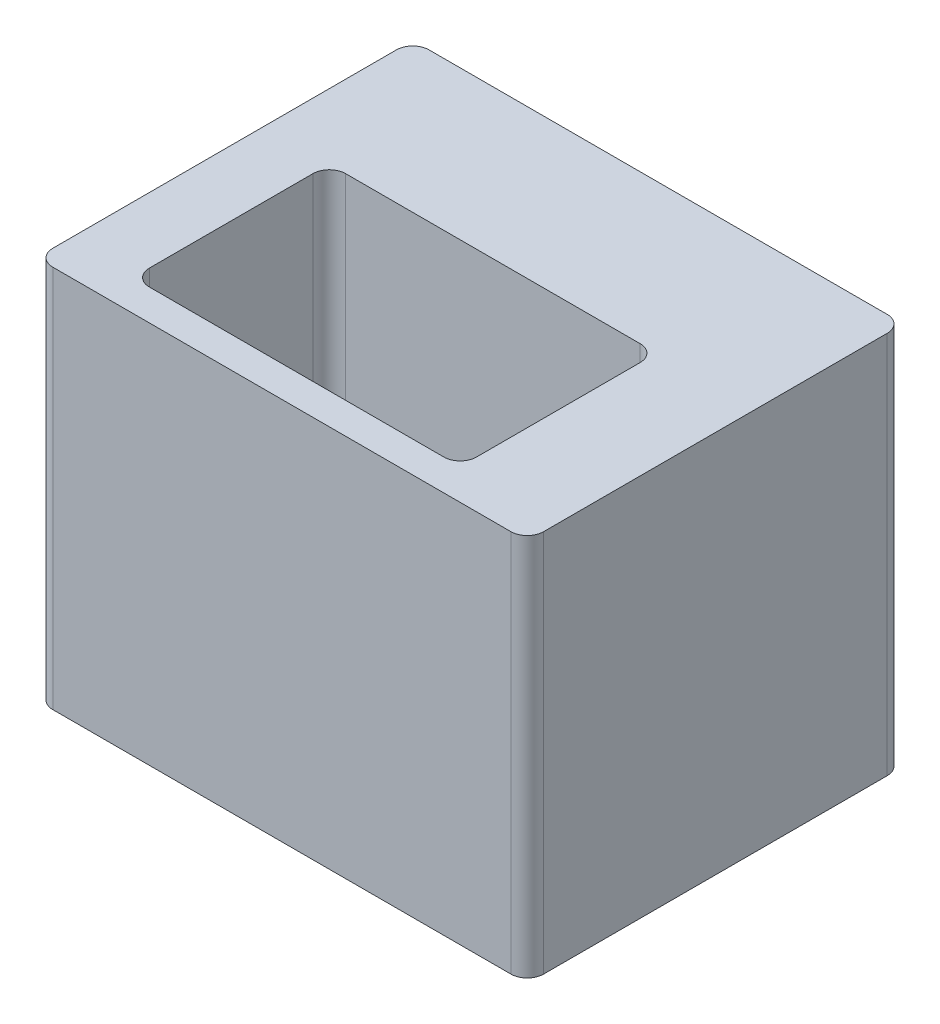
from build123d import *

# Parameters (mm, degrees)
SKETCH3_W           = 38.1
SKETCH3_H           = 29.21
BOSS_EXTRUDE2_DEPTH = 29.7434
SKETCH4_W           = 25.4
SKETCH4_H           = 15.24
CUT_EXTRUDE1_DEPTH  = 16.2052
FILLET1_R           = 1.27


with BuildPart() as part:
    # Sketch3 → Boss-Extrude2 (new body)
    with BuildSketch(Plane(origin=(0, 0, 0), x_dir=(1, 0, 0), z_dir=(0, 1, 0))):
        Rectangle(SKETCH3_W, SKETCH3_H)
    extrude(amount=BOSS_EXTRUDE2_DEPTH)

    # Sketch4 → Cut-Extrude1 (cut)
    with BuildSketch(Plane(origin=(0, 29.7434, 0), x_dir=(1, 0, 0), z_dir=(0, 1, 0))):
        with Locations((-1.27, -4.572)):
            Rectangle(SKETCH4_W, SKETCH4_H)
    extrude(amount=-CUT_EXTRUDE1_DEPTH, mode=Mode.SUBTRACT)

    # Fillet1
    fillet1_edges = [part.edges().sort_by_distance(p)[0] for p in [
        (-13.97, 21.6408, 12.192),
        (-13.97, 21.6408, -3.048),
        (11.43, 21.6408, -3.048),
        (11.43, 21.6408, 12.192),
        (-19.05, 14.8717, -14.605),
        (19.05, 14.8717, -14.605),
        (19.05, 14.8717, 14.605),
        (-19.05, 14.8717, 14.605),
    ]]
    fillet(fillet1_edges, radius=FILLET1_R)


solid = part.part
